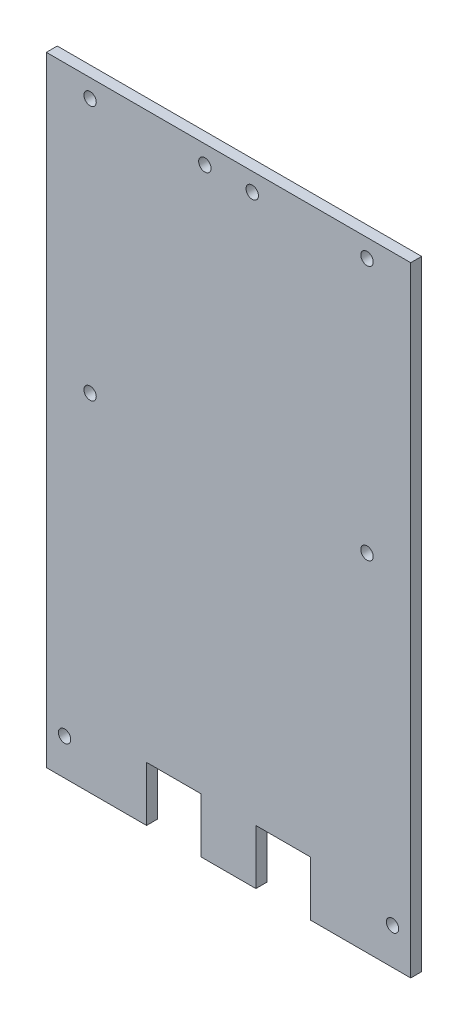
ISO-10303-21;
HEADER;
FILE_DESCRIPTION(('STEP AP214'),'2;1');
FILE_NAME('part.step','',(''),(''),'','','');
FILE_SCHEMA(('AUTOMOTIVE_DESIGN { 1 0 10303 214 1 1 1 1 }'));
ENDSEC;
DATA;
#1=APPLICATION_CONTEXT('core data for automotive mechanical design processes');
#2=APPLICATION_PROTOCOL_DEFINITION('international standard','automotive_design',2000,#1);
#3=PRODUCT_CONTEXT('',#1,'mechanical');
#4=PRODUCT('Part','Part','',(#3));
#5=PRODUCT_RELATED_PRODUCT_CATEGORY('part','',(#4));
#6=PRODUCT_DEFINITION_FORMATION('','',#4);
#7=PRODUCT_DEFINITION_CONTEXT('part definition',#1,'design');
#8=PRODUCT_DEFINITION('design','',#6,#7);
#9=PRODUCT_DEFINITION_SHAPE('','',#8);
#10=(LENGTH_UNIT() NAMED_UNIT(*) SI_UNIT(.MILLI.,.METRE.));
#11=(NAMED_UNIT(*) PLANE_ANGLE_UNIT() SI_UNIT($,.RADIAN.));
#12=(NAMED_UNIT(*) SI_UNIT($,.STERADIAN.) SOLID_ANGLE_UNIT());
#13=UNCERTAINTY_MEASURE_WITH_UNIT(LENGTH_MEASURE(1.E-05),#10,'distance_accuracy_value','');
#14=(GEOMETRIC_REPRESENTATION_CONTEXT(3) GLOBAL_UNCERTAINTY_ASSIGNED_CONTEXT((#13)) GLOBAL_UNIT_ASSIGNED_CONTEXT((#10,
#11,#12)) REPRESENTATION_CONTEXT('',''));
#15=CARTESIAN_POINT('',(0.,0.,0.));
#16=DIRECTION('',(0.,0.,1.));
#17=DIRECTION('',(1.,0.,0.));
#18=AXIS2_PLACEMENT_3D('',#15,#16,#17);
#19=CARTESIAN_POINT('',(-50.,-85.,3.));
#20=DIRECTION('',(0.,1.,0.));
#21=DIRECTION('',(0.,0.,1.));
#22=AXIS2_PLACEMENT_3D('',#19,#20,#21);
#23=PLANE('',#22);
#24=DIRECTION('',(1.,0.,0.));
#25=VECTOR('',#24,1.);
#26=CARTESIAN_POINT('',(-50.,-85.,3.));
#27=LINE('',#26,#25);
#28=CARTESIAN_POINT('',(22.5,-85.,3.));
#29=VERTEX_POINT('',#28);
#30=CARTESIAN_POINT('',(50.,-85.,3.));
#31=VERTEX_POINT('',#30);
#32=EDGE_CURVE('E175',#29,#31,#27,.T.);
#33=ORIENTED_EDGE('',*,*,#32,.F.);
#34=DIRECTION('',(0.,0.,-1.));
#35=VECTOR('',#34,1.);
#36=CARTESIAN_POINT('',(22.5,-85.,3.));
#37=LINE('',#36,#35);
#38=CARTESIAN_POINT('',(22.5,-85.,0.));
#39=VERTEX_POINT('',#38);
#40=EDGE_CURVE('E212',#29,#39,#37,.T.);
#41=ORIENTED_EDGE('',*,*,#40,.T.);
#42=DIRECTION('',(1.,0.,0.));
#43=VECTOR('',#42,1.);
#44=CARTESIAN_POINT('',(-50.,-85.,0.));
#45=LINE('',#44,#43);
#46=CARTESIAN_POINT('',(50.,-85.,0.));
#47=VERTEX_POINT('',#46);
#48=EDGE_CURVE('E142',#39,#47,#45,.T.);
#49=ORIENTED_EDGE('',*,*,#48,.T.);
#50=DIRECTION('',(0.,0.,-1.));
#51=VECTOR('',#50,1.);
#52=CARTESIAN_POINT('',(50.,-85.,3.));
#53=LINE('',#52,#51);
#54=EDGE_CURVE('E179',#31,#47,#53,.T.);
#55=ORIENTED_EDGE('',*,*,#54,.F.);
#56=EDGE_LOOP('',(#33,#41,#49,#55));
#57=FACE_BOUND('',#56,.T.);
#58=ADVANCED_FACE('F34',(#57),#23,.F.);
#59=CARTESIAN_POINT('',(-7.5,-85.,0.));
#60=VERTEX_POINT('',#59);
#61=CARTESIAN_POINT('',(7.5,-85.,0.));
#62=VERTEX_POINT('',#61);
#63=EDGE_CURVE('E148',#60,#62,#45,.T.);
#64=ORIENTED_EDGE('',*,*,#63,.T.);
#65=DIRECTION('',(0.,0.,1.));
#66=VECTOR('',#65,1.);
#67=CARTESIAN_POINT('',(7.49999999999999,-85.,3.));
#68=LINE('',#67,#66);
#69=CARTESIAN_POINT('',(7.5,-85.,3.));
#70=VERTEX_POINT('',#69);
#71=EDGE_CURVE('E235',#62,#70,#68,.T.);
#72=ORIENTED_EDGE('',*,*,#71,.T.);
#73=CARTESIAN_POINT('',(-7.5,-85.,3.));
#74=VERTEX_POINT('',#73);
#75=EDGE_CURVE('E180',#74,#70,#27,.T.);
#76=ORIENTED_EDGE('',*,*,#75,.F.);
#77=DIRECTION('',(0.,0.,-1.));
#78=VECTOR('',#77,1.);
#79=CARTESIAN_POINT('',(-7.50000000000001,-85.,3.));
#80=LINE('',#79,#78);
#81=EDGE_CURVE('E171',#74,#60,#80,.T.);
#82=ORIENTED_EDGE('',*,*,#81,.T.);
#83=EDGE_LOOP('',(#64,#72,#76,#82));
#84=FACE_BOUND('',#83,.T.);
#85=ADVANCED_FACE('F222',(#84),#23,.F.);
#86=CARTESIAN_POINT('',(50.,85.,3.));
#87=DIRECTION('',(-1.,0.,0.));
#88=DIRECTION('',(0.,-1.,0.));
#89=AXIS2_PLACEMENT_3D('',#86,#87,#88);
#90=PLANE('',#89);
#91=DIRECTION('',(0.,1.,0.));
#92=VECTOR('',#91,1.);
#93=CARTESIAN_POINT('',(50.,85.,0.));
#94=LINE('',#93,#92);
#95=CARTESIAN_POINT('',(50.,85.,0.));
#96=VERTEX_POINT('',#95);
#97=EDGE_CURVE('E144',#47,#96,#94,.T.);
#98=ORIENTED_EDGE('',*,*,#97,.T.);
#99=DIRECTION('',(0.,0.,-1.));
#100=VECTOR('',#99,1.);
#101=CARTESIAN_POINT('',(50.,85.,3.));
#102=LINE('',#101,#100);
#103=CARTESIAN_POINT('',(50.,85.,3.));
#104=VERTEX_POINT('',#103);
#105=EDGE_CURVE('E189',#104,#96,#102,.T.);
#106=ORIENTED_EDGE('',*,*,#105,.F.);
#107=DIRECTION('',(0.,1.,0.));
#108=VECTOR('',#107,1.);
#109=CARTESIAN_POINT('',(50.,85.,3.));
#110=LINE('',#109,#108);
#111=EDGE_CURVE('E157',#31,#104,#110,.T.);
#112=ORIENTED_EDGE('',*,*,#111,.F.);
#113=ORIENTED_EDGE('',*,*,#54,.T.);
#114=EDGE_LOOP('',(#98,#106,#112,#113));
#115=FACE_BOUND('',#114,.T.);
#116=ADVANCED_FACE('F36',(#115),#90,.F.);
#117=CARTESIAN_POINT('',(-50.,85.,3.));
#118=DIRECTION('',(0.,-1.,0.));
#119=DIRECTION('',(0.,0.,-1.));
#120=AXIS2_PLACEMENT_3D('',#117,#118,#119);
#121=PLANE('',#120);
#122=DIRECTION('',(-1.,0.,0.));
#123=VECTOR('',#122,1.);
#124=CARTESIAN_POINT('',(-50.,85.,0.));
#125=LINE('',#124,#123);
#126=CARTESIAN_POINT('',(-50.,85.,0.));
#127=VERTEX_POINT('',#126);
#128=EDGE_CURVE('E153',#96,#127,#125,.T.);
#129=ORIENTED_EDGE('',*,*,#128,.T.);
#130=DIRECTION('',(0.,0.,-1.));
#131=VECTOR('',#130,1.);
#132=CARTESIAN_POINT('',(-50.,85.,3.));
#133=LINE('',#132,#131);
#134=CARTESIAN_POINT('',(-50.,85.,3.));
#135=VERTEX_POINT('',#134);
#136=EDGE_CURVE('E187',#135,#127,#133,.T.);
#137=ORIENTED_EDGE('',*,*,#136,.F.);
#138=DIRECTION('',(-1.,0.,0.));
#139=VECTOR('',#138,1.);
#140=CARTESIAN_POINT('',(-50.,85.,3.));
#141=LINE('',#140,#139);
#142=EDGE_CURVE('E163',#104,#135,#141,.T.);
#143=ORIENTED_EDGE('',*,*,#142,.F.);
#144=ORIENTED_EDGE('',*,*,#105,.T.);
#145=EDGE_LOOP('',(#129,#137,#143,#144));
#146=FACE_BOUND('',#145,.T.);
#147=ADVANCED_FACE('F186',(#146),#121,.F.);
#148=CARTESIAN_POINT('',(-50.,85.,3.));
#149=DIRECTION('',(1.,0.,0.));
#150=DIRECTION('',(0.,1.,0.));
#151=AXIS2_PLACEMENT_3D('',#148,#149,#150);
#152=PLANE('',#151);
#153=DIRECTION('',(0.,-1.,0.));
#154=VECTOR('',#153,1.);
#155=CARTESIAN_POINT('',(-50.,85.,0.));
#156=LINE('',#155,#154);
#157=CARTESIAN_POINT('',(-50.,-85.,0.));
#158=VERTEX_POINT('',#157);
#159=EDGE_CURVE('E149',#127,#158,#156,.T.);
#160=ORIENTED_EDGE('',*,*,#159,.T.);
#161=DIRECTION('',(0.,0.,-1.));
#162=VECTOR('',#161,1.);
#163=CARTESIAN_POINT('',(-50.,-85.,3.));
#164=LINE('',#163,#162);
#165=CARTESIAN_POINT('',(-50.,-85.,3.));
#166=VERTEX_POINT('',#165);
#167=EDGE_CURVE('E194',#166,#158,#164,.T.);
#168=ORIENTED_EDGE('',*,*,#167,.F.);
#169=DIRECTION('',(0.,-1.,0.));
#170=VECTOR('',#169,1.);
#171=CARTESIAN_POINT('',(-50.,85.,3.));
#172=LINE('',#171,#170);
#173=EDGE_CURVE('E168',#135,#166,#172,.T.);
#174=ORIENTED_EDGE('',*,*,#173,.F.);
#175=ORIENTED_EDGE('',*,*,#136,.T.);
#176=EDGE_LOOP('',(#160,#168,#174,#175));
#177=FACE_BOUND('',#176,.T.);
#178=ADVANCED_FACE('F192',(#177),#152,.F.);
#179=CARTESIAN_POINT('',(-22.5,-85.,0.));
#180=VERTEX_POINT('',#179);
#181=EDGE_CURVE('E151',#158,#180,#45,.T.);
#182=ORIENTED_EDGE('',*,*,#181,.T.);
#183=DIRECTION('',(0.,0.,1.));
#184=VECTOR('',#183,1.);
#185=CARTESIAN_POINT('',(-22.5,-85.,3.));
#186=LINE('',#185,#184);
#187=CARTESIAN_POINT('',(-22.5,-85.,3.));
#188=VERTEX_POINT('',#187);
#189=EDGE_CURVE('E216',#180,#188,#186,.T.);
#190=ORIENTED_EDGE('',*,*,#189,.T.);
#191=EDGE_CURVE('E176',#166,#188,#27,.T.);
#192=ORIENTED_EDGE('',*,*,#191,.F.);
#193=ORIENTED_EDGE('',*,*,#167,.T.);
#194=EDGE_LOOP('',(#182,#190,#192,#193));
#195=FACE_BOUND('',#194,.T.);
#196=ADVANCED_FACE('F254',(#195),#23,.F.);
#197=CARTESIAN_POINT('',(0.,0.,3.));
#198=DIRECTION('',(0.,0.,1.));
#199=DIRECTION('',(1.,0.,0.));
#200=AXIS2_PLACEMENT_3D('',#197,#198,#199);
#201=PLANE('',#200);
#202=CARTESIAN_POINT('',(-38.,80.,3.));
#203=DIRECTION('',(0.,0.,1.));
#204=DIRECTION('',(1.,0.,0.));
#205=AXIS2_PLACEMENT_3D('',#202,#203,#204);
#206=CIRCLE('',#205,1.69999999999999);
#207=CARTESIAN_POINT('',(-36.3,80.,3.));
#208=VERTEX_POINT('',#207);
#209=EDGE_CURVE('E413',#208,#208,#206,.T.);
#210=ORIENTED_EDGE('',*,*,#209,.F.);
#211=EDGE_LOOP('',(#210));
#212=FACE_BOUND('',#211,.T.);
#213=CARTESIAN_POINT('',(38.,80.,3.));
#214=DIRECTION('',(0.,0.,1.));
#215=DIRECTION('',(1.,0.,0.));
#216=AXIS2_PLACEMENT_3D('',#213,#214,#215);
#217=CIRCLE('',#216,1.69999999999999);
#218=CARTESIAN_POINT('',(39.7,80.,3.));
#219=VERTEX_POINT('',#218);
#220=EDGE_CURVE('E415',#219,#219,#217,.T.);
#221=ORIENTED_EDGE('',*,*,#220,.F.);
#222=EDGE_LOOP('',(#221));
#223=FACE_BOUND('',#222,.T.);
#224=CARTESIAN_POINT('',(-38.,9.99999999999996,3.));
#225=DIRECTION('',(0.,0.,1.));
#226=DIRECTION('',(1.,0.,0.));
#227=AXIS2_PLACEMENT_3D('',#224,#225,#226);
#228=CIRCLE('',#227,1.69999999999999);
#229=CARTESIAN_POINT('',(-36.3,9.99999999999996,3.));
#230=VERTEX_POINT('',#229);
#231=EDGE_CURVE('E423',#230,#230,#228,.T.);
#232=ORIENTED_EDGE('',*,*,#231,.F.);
#233=EDGE_LOOP('',(#232));
#234=FACE_BOUND('',#233,.T.);
#235=CARTESIAN_POINT('',(38.,9.99999999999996,3.));
#236=DIRECTION('',(0.,0.,1.));
#237=DIRECTION('',(1.,0.,0.));
#238=AXIS2_PLACEMENT_3D('',#235,#236,#237);
#239=CIRCLE('',#238,1.69999999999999);
#240=CARTESIAN_POINT('',(39.7,9.99999999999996,3.));
#241=VERTEX_POINT('',#240);
#242=EDGE_CURVE('E429',#241,#241,#239,.T.);
#243=ORIENTED_EDGE('',*,*,#242,.F.);
#244=EDGE_LOOP('',(#243));
#245=FACE_BOUND('',#244,.T.);
#246=CARTESIAN_POINT('',(-45.,-75.,3.));
#247=DIRECTION('',(0.,0.,1.));
#248=DIRECTION('',(1.,0.,0.));
#249=AXIS2_PLACEMENT_3D('',#246,#247,#248);
#250=CIRCLE('',#249,1.69999999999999);
#251=CARTESIAN_POINT('',(-43.3,-75.,3.));
#252=VERTEX_POINT('',#251);
#253=EDGE_CURVE('E435',#252,#252,#250,.T.);
#254=ORIENTED_EDGE('',*,*,#253,.F.);
#255=EDGE_LOOP('',(#254));
#256=FACE_BOUND('',#255,.T.);
#257=CARTESIAN_POINT('',(45.,-75.,3.));
#258=DIRECTION('',(0.,0.,1.));
#259=DIRECTION('',(1.,0.,0.));
#260=AXIS2_PLACEMENT_3D('',#257,#258,#259);
#261=CIRCLE('',#260,1.69999999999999);
#262=CARTESIAN_POINT('',(46.7,-75.,3.));
#263=VERTEX_POINT('',#262);
#264=EDGE_CURVE('E441',#263,#263,#261,.T.);
#265=ORIENTED_EDGE('',*,*,#264,.F.);
#266=EDGE_LOOP('',(#265));
#267=FACE_BOUND('',#266,.T.);
#268=CARTESIAN_POINT('',(-6.50000000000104,79.9999999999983,3.));
#269=DIRECTION('',(0.,0.,1.));
#270=DIRECTION('',(1.,0.,0.));
#271=AXIS2_PLACEMENT_3D('',#268,#269,#270);
#272=CIRCLE('',#271,1.69999999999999);
#273=CARTESIAN_POINT('',(-4.80000000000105,79.9999999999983,3.));
#274=VERTEX_POINT('',#273);
#275=EDGE_CURVE('E447',#274,#274,#272,.T.);
#276=ORIENTED_EDGE('',*,*,#275,.F.);
#277=EDGE_LOOP('',(#276));
#278=FACE_BOUND('',#277,.T.);
#279=CARTESIAN_POINT('',(6.49999999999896,79.9999999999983,3.));
#280=DIRECTION('',(0.,0.,1.));
#281=DIRECTION('',(1.,0.,0.));
#282=AXIS2_PLACEMENT_3D('',#279,#280,#281);
#283=CIRCLE('',#282,1.69999999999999);
#284=CARTESIAN_POINT('',(8.19999999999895,79.9999999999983,3.));
#285=VERTEX_POINT('',#284);
#286=EDGE_CURVE('E453',#285,#285,#283,.T.);
#287=ORIENTED_EDGE('',*,*,#286,.F.);
#288=EDGE_LOOP('',(#287));
#289=FACE_BOUND('',#288,.T.);
#290=DIRECTION('',(0.,1.,0.));
#291=VECTOR('',#290,1.);
#292=CARTESIAN_POINT('',(22.5,-100.,3.));
#293=LINE('',#292,#291);
#294=CARTESIAN_POINT('',(22.5,-70.,3.));
#295=VERTEX_POINT('',#294);
#296=EDGE_CURVE('E127',#29,#295,#293,.T.);
#297=ORIENTED_EDGE('',*,*,#296,.F.);
#298=ORIENTED_EDGE('',*,*,#32,.T.);
#299=ORIENTED_EDGE('',*,*,#111,.T.);
#300=ORIENTED_EDGE('',*,*,#142,.T.);
#301=ORIENTED_EDGE('',*,*,#173,.T.);
#302=ORIENTED_EDGE('',*,*,#191,.T.);
#303=DIRECTION('',(0.,-1.,0.));
#304=VECTOR('',#303,1.);
#305=CARTESIAN_POINT('',(-22.5,-100.,3.));
#306=LINE('',#305,#304);
#307=CARTESIAN_POINT('',(-22.5,-70.,3.));
#308=VERTEX_POINT('',#307);
#309=EDGE_CURVE('E205',#308,#188,#306,.T.);
#310=ORIENTED_EDGE('',*,*,#309,.F.);
#311=DIRECTION('',(-1.,0.,0.));
#312=VECTOR('',#311,1.);
#313=CARTESIAN_POINT('',(-22.5,-70.,3.));
#314=LINE('',#313,#312);
#315=CARTESIAN_POINT('',(-7.5,-70.,3.));
#316=VERTEX_POINT('',#315);
#317=EDGE_CURVE('E211',#316,#308,#314,.T.);
#318=ORIENTED_EDGE('',*,*,#317,.F.);
#319=DIRECTION('',(0.,1.,0.));
#320=VECTOR('',#319,1.);
#321=CARTESIAN_POINT('',(-7.5,-100.,3.));
#322=LINE('',#321,#320);
#323=EDGE_CURVE('E209',#74,#316,#322,.T.);
#324=ORIENTED_EDGE('',*,*,#323,.F.);
#325=ORIENTED_EDGE('',*,*,#75,.T.);
#326=DIRECTION('',(0.,-1.,0.));
#327=VECTOR('',#326,1.);
#328=CARTESIAN_POINT('',(7.5,-100.,3.));
#329=LINE('',#328,#327);
#330=CARTESIAN_POINT('',(7.5,-70.,3.));
#331=VERTEX_POINT('',#330);
#332=EDGE_CURVE('E137',#331,#70,#329,.T.);
#333=ORIENTED_EDGE('',*,*,#332,.F.);
#334=DIRECTION('',(-1.,0.,0.));
#335=VECTOR('',#334,1.);
#336=CARTESIAN_POINT('',(7.5,-70.,3.));
#337=LINE('',#336,#335);
#338=EDGE_CURVE('E231',#295,#331,#337,.T.);
#339=ORIENTED_EDGE('',*,*,#338,.F.);
#340=EDGE_LOOP('',(#297,#298,#299,#300,#301,#302,#310,#318,#324,#325,#333,#339));
#341=FACE_BOUND('',#340,.T.);
#342=ADVANCED_FACE('F238',(#212,#223,#234,#245,#256,#267,#278,#289,#341),#201,.T.);
#343=CARTESIAN_POINT('',(0.,0.,0.));
#344=DIRECTION('',(0.,0.,1.));
#345=DIRECTION('',(1.,0.,0.));
#346=AXIS2_PLACEMENT_3D('',#343,#344,#345);
#347=PLANE('',#346);
#348=CARTESIAN_POINT('',(-38.,80.,0.));
#349=DIRECTION('',(0.,0.,1.));
#350=DIRECTION('',(1.,0.,0.));
#351=AXIS2_PLACEMENT_3D('',#348,#349,#350);
#352=CIRCLE('',#351,1.69999999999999);
#353=CARTESIAN_POINT('',(-36.3,80.,0.));
#354=VERTEX_POINT('',#353);
#355=EDGE_CURVE('E410',#354,#354,#352,.T.);
#356=ORIENTED_EDGE('',*,*,#355,.T.);
#357=EDGE_LOOP('',(#356));
#358=FACE_BOUND('',#357,.T.);
#359=CARTESIAN_POINT('',(38.,80.,0.));
#360=DIRECTION('',(0.,0.,1.));
#361=DIRECTION('',(1.,0.,0.));
#362=AXIS2_PLACEMENT_3D('',#359,#360,#361);
#363=CIRCLE('',#362,1.69999999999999);
#364=CARTESIAN_POINT('',(39.7,80.,0.));
#365=VERTEX_POINT('',#364);
#366=EDGE_CURVE('E420',#365,#365,#363,.T.);
#367=ORIENTED_EDGE('',*,*,#366,.T.);
#368=EDGE_LOOP('',(#367));
#369=FACE_BOUND('',#368,.T.);
#370=CARTESIAN_POINT('',(-38.,9.99999999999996,0.));
#371=DIRECTION('',(0.,0.,1.));
#372=DIRECTION('',(1.,0.,0.));
#373=AXIS2_PLACEMENT_3D('',#370,#371,#372);
#374=CIRCLE('',#373,1.69999999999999);
#375=CARTESIAN_POINT('',(-36.3,9.99999999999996,0.));
#376=VERTEX_POINT('',#375);
#377=EDGE_CURVE('E426',#376,#376,#374,.T.);
#378=ORIENTED_EDGE('',*,*,#377,.T.);
#379=EDGE_LOOP('',(#378));
#380=FACE_BOUND('',#379,.T.);
#381=CARTESIAN_POINT('',(38.,9.99999999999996,0.));
#382=DIRECTION('',(0.,0.,1.));
#383=DIRECTION('',(1.,0.,0.));
#384=AXIS2_PLACEMENT_3D('',#381,#382,#383);
#385=CIRCLE('',#384,1.69999999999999);
#386=CARTESIAN_POINT('',(39.7,9.99999999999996,0.));
#387=VERTEX_POINT('',#386);
#388=EDGE_CURVE('E432',#387,#387,#385,.T.);
#389=ORIENTED_EDGE('',*,*,#388,.T.);
#390=EDGE_LOOP('',(#389));
#391=FACE_BOUND('',#390,.T.);
#392=CARTESIAN_POINT('',(-45.,-75.,0.));
#393=DIRECTION('',(0.,0.,1.));
#394=DIRECTION('',(1.,0.,0.));
#395=AXIS2_PLACEMENT_3D('',#392,#393,#394);
#396=CIRCLE('',#395,1.7);
#397=CARTESIAN_POINT('',(-43.3,-75.,0.));
#398=VERTEX_POINT('',#397);
#399=EDGE_CURVE('E438',#398,#398,#396,.T.);
#400=ORIENTED_EDGE('',*,*,#399,.T.);
#401=EDGE_LOOP('',(#400));
#402=FACE_BOUND('',#401,.T.);
#403=CARTESIAN_POINT('',(45.,-75.,0.));
#404=DIRECTION('',(0.,0.,1.));
#405=DIRECTION('',(1.,0.,0.));
#406=AXIS2_PLACEMENT_3D('',#403,#404,#405);
#407=CIRCLE('',#406,1.7);
#408=CARTESIAN_POINT('',(46.7,-75.,0.));
#409=VERTEX_POINT('',#408);
#410=EDGE_CURVE('E444',#409,#409,#407,.T.);
#411=ORIENTED_EDGE('',*,*,#410,.T.);
#412=EDGE_LOOP('',(#411));
#413=FACE_BOUND('',#412,.T.);
#414=CARTESIAN_POINT('',(-6.50000000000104,79.9999999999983,0.));
#415=DIRECTION('',(0.,0.,1.));
#416=DIRECTION('',(1.,0.,0.));
#417=AXIS2_PLACEMENT_3D('',#414,#415,#416);
#418=CIRCLE('',#417,1.7);
#419=CARTESIAN_POINT('',(-4.80000000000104,79.9999999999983,0.));
#420=VERTEX_POINT('',#419);
#421=EDGE_CURVE('E450',#420,#420,#418,.T.);
#422=ORIENTED_EDGE('',*,*,#421,.T.);
#423=EDGE_LOOP('',(#422));
#424=FACE_BOUND('',#423,.T.);
#425=CARTESIAN_POINT('',(6.49999999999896,79.9999999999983,0.));
#426=DIRECTION('',(0.,0.,1.));
#427=DIRECTION('',(1.,0.,0.));
#428=AXIS2_PLACEMENT_3D('',#425,#426,#427);
#429=CIRCLE('',#428,1.7);
#430=CARTESIAN_POINT('',(8.19999999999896,79.9999999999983,0.));
#431=VERTEX_POINT('',#430);
#432=EDGE_CURVE('E232',#431,#431,#429,.T.);
#433=ORIENTED_EDGE('',*,*,#432,.T.);
#434=EDGE_LOOP('',(#433));
#435=FACE_BOUND('',#434,.T.);
#436=ORIENTED_EDGE('',*,*,#48,.F.);
#437=DIRECTION('',(0.,1.,0.));
#438=VECTOR('',#437,1.);
#439=CARTESIAN_POINT('',(22.5,0.,0.));
#440=LINE('',#439,#438);
#441=CARTESIAN_POINT('',(22.5,-70.,0.));
#442=VERTEX_POINT('',#441);
#443=EDGE_CURVE('E11',#39,#442,#440,.T.);
#444=ORIENTED_EDGE('',*,*,#443,.T.);
#445=DIRECTION('',(-1.,0.,0.));
#446=VECTOR('',#445,1.);
#447=CARTESIAN_POINT('',(7.5,-70.,0.));
#448=LINE('',#447,#446);
#449=CARTESIAN_POINT('',(7.5,-70.,0.));
#450=VERTEX_POINT('',#449);
#451=EDGE_CURVE('E134',#442,#450,#448,.T.);
#452=ORIENTED_EDGE('',*,*,#451,.T.);
#453=DIRECTION('',(0.,-1.,0.));
#454=VECTOR('',#453,1.);
#455=CARTESIAN_POINT('',(7.5,-100.,0.));
#456=LINE('',#455,#454);
#457=EDGE_CURVE('E49',#450,#62,#456,.T.);
#458=ORIENTED_EDGE('',*,*,#457,.T.);
#459=ORIENTED_EDGE('',*,*,#63,.F.);
#460=DIRECTION('',(0.,1.,0.));
#461=VECTOR('',#460,1.);
#462=CARTESIAN_POINT('',(-7.5,0.,0.));
#463=LINE('',#462,#461);
#464=CARTESIAN_POINT('',(-7.5,-70.,0.));
#465=VERTEX_POINT('',#464);
#466=EDGE_CURVE('E42',#60,#465,#463,.T.);
#467=ORIENTED_EDGE('',*,*,#466,.T.);
#468=DIRECTION('',(-1.,0.,0.));
#469=VECTOR('',#468,1.);
#470=CARTESIAN_POINT('',(-22.5,-70.,0.));
#471=LINE('',#470,#469);
#472=CARTESIAN_POINT('',(-22.5,-70.,0.));
#473=VERTEX_POINT('',#472);
#474=EDGE_CURVE('E199',#465,#473,#471,.T.);
#475=ORIENTED_EDGE('',*,*,#474,.T.);
#476=DIRECTION('',(0.,-1.,0.));
#477=VECTOR('',#476,1.);
#478=CARTESIAN_POINT('',(-22.5,-100.,0.));
#479=LINE('',#478,#477);
#480=EDGE_CURVE('E57',#473,#180,#479,.T.);
#481=ORIENTED_EDGE('',*,*,#480,.T.);
#482=ORIENTED_EDGE('',*,*,#181,.F.);
#483=ORIENTED_EDGE('',*,*,#159,.F.);
#484=ORIENTED_EDGE('',*,*,#128,.F.);
#485=ORIENTED_EDGE('',*,*,#97,.F.);
#486=EDGE_LOOP('',(#436,#444,#452,#458,#459,#467,#475,#481,#482,#483,#484,#485));
#487=FACE_BOUND('',#486,.T.);
#488=ADVANCED_FACE('F140',(#358,#369,#380,#391,#402,#413,#424,#435,#487),#347,.F.);
#489=CARTESIAN_POINT('',(-7.5,-100.,0.));
#490=DIRECTION('',(1.,0.,0.));
#491=DIRECTION('',(0.,0.,-1.));
#492=AXIS2_PLACEMENT_3D('',#489,#490,#491);
#493=PLANE('',#492);
#494=ORIENTED_EDGE('',*,*,#323,.T.);
#495=DIRECTION('',(0.,0.,1.));
#496=VECTOR('',#495,1.);
#497=CARTESIAN_POINT('',(-7.5,-70.,0.));
#498=LINE('',#497,#496);
#499=EDGE_CURVE('E200',#465,#316,#498,.T.);
#500=ORIENTED_EDGE('',*,*,#499,.F.);
#501=ORIENTED_EDGE('',*,*,#466,.F.);
#502=ORIENTED_EDGE('',*,*,#81,.F.);
#503=EDGE_LOOP('',(#494,#500,#501,#502));
#504=FACE_BOUND('',#503,.T.);
#505=ADVANCED_FACE('F282',(#504),#493,.F.);
#506=CARTESIAN_POINT('',(-22.5,-100.,0.));
#507=DIRECTION('',(-1.,0.,0.));
#508=DIRECTION('',(0.,0.,1.));
#509=AXIS2_PLACEMENT_3D('',#506,#507,#508);
#510=PLANE('',#509);
#511=ORIENTED_EDGE('',*,*,#480,.F.);
#512=DIRECTION('',(0.,0.,1.));
#513=VECTOR('',#512,1.);
#514=CARTESIAN_POINT('',(-22.5,-70.,0.));
#515=LINE('',#514,#513);
#516=EDGE_CURVE('E203',#473,#308,#515,.T.);
#517=ORIENTED_EDGE('',*,*,#516,.T.);
#518=ORIENTED_EDGE('',*,*,#309,.T.);
#519=ORIENTED_EDGE('',*,*,#189,.F.);
#520=EDGE_LOOP('',(#511,#517,#518,#519));
#521=FACE_BOUND('',#520,.T.);
#522=ADVANCED_FACE('F280',(#521),#510,.F.);
#523=CARTESIAN_POINT('',(-22.5,-70.,0.));
#524=DIRECTION('',(0.,1.,0.));
#525=DIRECTION('',(0.,0.,1.));
#526=AXIS2_PLACEMENT_3D('',#523,#524,#525);
#527=PLANE('',#526);
#528=ORIENTED_EDGE('',*,*,#317,.T.);
#529=ORIENTED_EDGE('',*,*,#516,.F.);
#530=ORIENTED_EDGE('',*,*,#474,.F.);
#531=ORIENTED_EDGE('',*,*,#499,.T.);
#532=EDGE_LOOP('',(#528,#529,#530,#531));
#533=FACE_BOUND('',#532,.T.);
#534=ADVANCED_FACE('F249',(#533),#527,.F.);
#535=CARTESIAN_POINT('',(22.5,-100.,0.));
#536=DIRECTION('',(1.,0.,0.));
#537=DIRECTION('',(0.,0.,-1.));
#538=AXIS2_PLACEMENT_3D('',#535,#536,#537);
#539=PLANE('',#538);
#540=ORIENTED_EDGE('',*,*,#296,.T.);
#541=DIRECTION('',(0.,0.,1.));
#542=VECTOR('',#541,1.);
#543=CARTESIAN_POINT('',(22.5,-70.,0.));
#544=LINE('',#543,#542);
#545=EDGE_CURVE('E122',#442,#295,#544,.T.);
#546=ORIENTED_EDGE('',*,*,#545,.F.);
#547=ORIENTED_EDGE('',*,*,#443,.F.);
#548=ORIENTED_EDGE('',*,*,#40,.F.);
#549=EDGE_LOOP('',(#540,#546,#547,#548));
#550=FACE_BOUND('',#549,.T.);
#551=ADVANCED_FACE('F124',(#550),#539,.F.);
#552=CARTESIAN_POINT('',(7.5,-100.,0.));
#553=DIRECTION('',(-1.,0.,0.));
#554=DIRECTION('',(0.,0.,1.));
#555=AXIS2_PLACEMENT_3D('',#552,#553,#554);
#556=PLANE('',#555);
#557=ORIENTED_EDGE('',*,*,#457,.F.);
#558=DIRECTION('',(0.,0.,1.));
#559=VECTOR('',#558,1.);
#560=CARTESIAN_POINT('',(7.5,-70.,0.));
#561=LINE('',#560,#559);
#562=EDGE_CURVE('E131',#450,#331,#561,.T.);
#563=ORIENTED_EDGE('',*,*,#562,.T.);
#564=ORIENTED_EDGE('',*,*,#332,.T.);
#565=ORIENTED_EDGE('',*,*,#71,.F.);
#566=EDGE_LOOP('',(#557,#563,#564,#565));
#567=FACE_BOUND('',#566,.T.);
#568=ADVANCED_FACE('F240',(#567),#556,.F.);
#569=CARTESIAN_POINT('',(7.5,-70.,0.));
#570=DIRECTION('',(0.,1.,0.));
#571=DIRECTION('',(0.,0.,1.));
#572=AXIS2_PLACEMENT_3D('',#569,#570,#571);
#573=PLANE('',#572);
#574=ORIENTED_EDGE('',*,*,#338,.T.);
#575=ORIENTED_EDGE('',*,*,#562,.F.);
#576=ORIENTED_EDGE('',*,*,#451,.F.);
#577=ORIENTED_EDGE('',*,*,#545,.T.);
#578=EDGE_LOOP('',(#574,#575,#576,#577));
#579=FACE_BOUND('',#578,.T.);
#580=ADVANCED_FACE('F135',(#579),#573,.F.);
#581=CARTESIAN_POINT('',(6.49999999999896,79.9999999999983,3.));
#582=DIRECTION('',(0.,0.,1.));
#583=DIRECTION('',(1.,0.,0.));
#584=AXIS2_PLACEMENT_3D('',#581,#582,#583);
#585=CYLINDRICAL_SURFACE('',#584,1.69999999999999);
#586=ORIENTED_EDGE('',*,*,#432,.F.);
#587=EDGE_LOOP('',(#586));
#588=FACE_BOUND('',#587,.T.);
#589=ORIENTED_EDGE('',*,*,#286,.T.);
#590=EDGE_LOOP('',(#589));
#591=FACE_BOUND('',#590,.T.);
#592=ADVANCED_FACE('F247',(#588,#591),#585,.F.);
#593=CARTESIAN_POINT('',(-6.50000000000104,79.9999999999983,3.));
#594=DIRECTION('',(0.,0.,1.));
#595=DIRECTION('',(1.,0.,0.));
#596=AXIS2_PLACEMENT_3D('',#593,#594,#595);
#597=CYLINDRICAL_SURFACE('',#596,1.69999999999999);
#598=ORIENTED_EDGE('',*,*,#421,.F.);
#599=EDGE_LOOP('',(#598));
#600=FACE_BOUND('',#599,.T.);
#601=ORIENTED_EDGE('',*,*,#275,.T.);
#602=EDGE_LOOP('',(#601));
#603=FACE_BOUND('',#602,.T.);
#604=ADVANCED_FACE('F320',(#600,#603),#597,.F.);
#605=CARTESIAN_POINT('',(45.,-75.,3.));
#606=DIRECTION('',(0.,0.,1.));
#607=DIRECTION('',(1.,0.,0.));
#608=AXIS2_PLACEMENT_3D('',#605,#606,#607);
#609=CYLINDRICAL_SURFACE('',#608,1.69999999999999);
#610=ORIENTED_EDGE('',*,*,#410,.F.);
#611=EDGE_LOOP('',(#610));
#612=FACE_BOUND('',#611,.T.);
#613=ORIENTED_EDGE('',*,*,#264,.T.);
#614=EDGE_LOOP('',(#613));
#615=FACE_BOUND('',#614,.T.);
#616=ADVANCED_FACE('F329',(#612,#615),#609,.F.);
#617=CARTESIAN_POINT('',(-45.,-75.,3.));
#618=DIRECTION('',(0.,0.,1.));
#619=DIRECTION('',(1.,0.,0.));
#620=AXIS2_PLACEMENT_3D('',#617,#618,#619);
#621=CYLINDRICAL_SURFACE('',#620,1.69999999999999);
#622=ORIENTED_EDGE('',*,*,#399,.F.);
#623=EDGE_LOOP('',(#622));
#624=FACE_BOUND('',#623,.T.);
#625=ORIENTED_EDGE('',*,*,#253,.T.);
#626=EDGE_LOOP('',(#625));
#627=FACE_BOUND('',#626,.T.);
#628=ADVANCED_FACE('F339',(#624,#627),#621,.F.);
#629=CARTESIAN_POINT('',(38.,9.99999999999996,3.));
#630=DIRECTION('',(0.,0.,1.));
#631=DIRECTION('',(1.,0.,0.));
#632=AXIS2_PLACEMENT_3D('',#629,#630,#631);
#633=CYLINDRICAL_SURFACE('',#632,1.69999999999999);
#634=ORIENTED_EDGE('',*,*,#388,.F.);
#635=EDGE_LOOP('',(#634));
#636=FACE_BOUND('',#635,.T.);
#637=ORIENTED_EDGE('',*,*,#242,.T.);
#638=EDGE_LOOP('',(#637));
#639=FACE_BOUND('',#638,.T.);
#640=ADVANCED_FACE('F349',(#636,#639),#633,.F.);
#641=CARTESIAN_POINT('',(-38.,9.99999999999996,3.));
#642=DIRECTION('',(0.,0.,1.));
#643=DIRECTION('',(1.,0.,0.));
#644=AXIS2_PLACEMENT_3D('',#641,#642,#643);
#645=CYLINDRICAL_SURFACE('',#644,1.69999999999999);
#646=ORIENTED_EDGE('',*,*,#377,.F.);
#647=EDGE_LOOP('',(#646));
#648=FACE_BOUND('',#647,.T.);
#649=ORIENTED_EDGE('',*,*,#231,.T.);
#650=EDGE_LOOP('',(#649));
#651=FACE_BOUND('',#650,.T.);
#652=ADVANCED_FACE('F373',(#648,#651),#645,.F.);
#653=CARTESIAN_POINT('',(38.,80.,3.));
#654=DIRECTION('',(0.,0.,1.));
#655=DIRECTION('',(1.,0.,0.));
#656=AXIS2_PLACEMENT_3D('',#653,#654,#655);
#657=CYLINDRICAL_SURFACE('',#656,1.69999999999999);
#658=ORIENTED_EDGE('',*,*,#366,.F.);
#659=EDGE_LOOP('',(#658));
#660=FACE_BOUND('',#659,.T.);
#661=ORIENTED_EDGE('',*,*,#220,.T.);
#662=EDGE_LOOP('',(#661));
#663=FACE_BOUND('',#662,.T.);
#664=ADVANCED_FACE('F383',(#660,#663),#657,.F.);
#665=CARTESIAN_POINT('',(-38.,80.,3.));
#666=DIRECTION('',(0.,0.,1.));
#667=DIRECTION('',(1.,0.,0.));
#668=AXIS2_PLACEMENT_3D('',#665,#666,#667);
#669=CYLINDRICAL_SURFACE('',#668,1.69999999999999);
#670=ORIENTED_EDGE('',*,*,#355,.F.);
#671=EDGE_LOOP('',(#670));
#672=FACE_BOUND('',#671,.T.);
#673=ORIENTED_EDGE('',*,*,#209,.T.);
#674=EDGE_LOOP('',(#673));
#675=FACE_BOUND('',#674,.T.);
#676=ADVANCED_FACE('F393',(#672,#675),#669,.F.);
#677=CLOSED_SHELL('',(#58,#85,#116,#147,#178,#196,#342,#488,#505,#522,#534,#551,#568,#580,#592,
#604,#616,#628,#640,#652,#664,#676));
#678=MANIFOLD_SOLID_BREP('B2',#677);
#679=ADVANCED_BREP_SHAPE_REPRESENTATION('',(#18,#678),#14);
#680=SHAPE_DEFINITION_REPRESENTATION(#9,#679);
ENDSEC;
END-ISO-10303-21;
